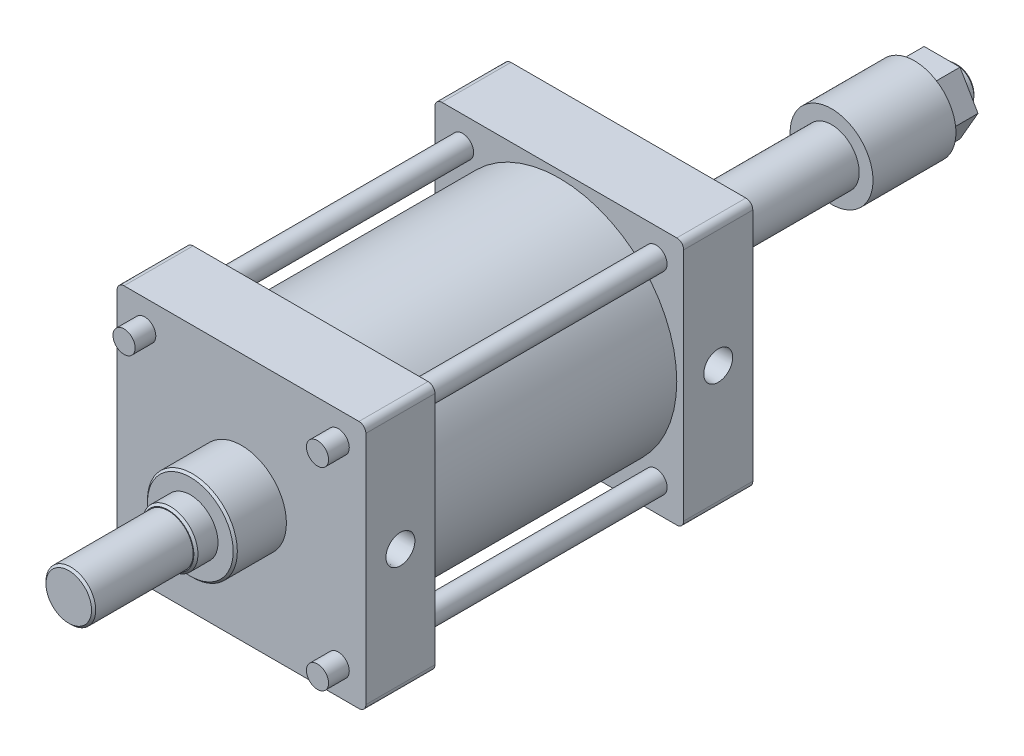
from build123d import *

# Parameters (mm, degrees)
SKETCH_1_R              = 8
EXTRUDE_1_DEPTH         = 50
SKETCH_2_R              = 85
EXTRUDE_2_DEPTH         = 180
EXTRUDE_START           = 50
SKETCH_3_R              = 8
EXTRUDE_3_DEPTH         = 50
SKETCH_4_R              = 32.5
EXTRUDE_4_DEPTH         = 37
EXTRUDE_START_2         = 37
SKETCH_5_R              = 32.5
EXTRUDE_5_DEPTH         = 37
SKETCH_6_R              = 20
EXTRUDE_7_DEPTH         = 16
SKETCH_7_R              = 18
EXTRUDE_8_DEPTH         = 72
CHAMFER_1_SIZE          = 1.5
SKETCH_8_R              = 30
EXTRUDE_9_DEPTH         = 10
EXTRUDE_START_3         = 100
SKETCH_9_R              = 20
EXTRUDE_10_DEPTH        = 100
SKETCH_10_R             = 30
EXTRUDE_11_DEPTH        = 60
EXTRUDE_12_DEPTH        = 20
SKETCH_12_R             = 13.5
EXTRUDE_13_DEPTH        = 11
CHAMFER_2_SIZE          = 1.5
EXTRUDE_14_DEPTH        = 15
EXTRUDE_14_DEPTH_BACK   = 280
SKETCH_13_R             = 8
EXTRUDE_14_2_DEPTH      = 15
EXTRUDE_14_2_DEPTH_BACK = 280
EXTRUDE_14_3_DEPTH      = 15
EXTRUDE_14_3_DEPTH_BACK = 280
EXTRUDE_14_4_DEPTH      = 15
EXTRUDE_14_4_DEPTH_BACK = 280
F_1_2_RC_1_AT_2_COUNT   = 2
F_1_2_RC_1_AT_2_PITCH   = 230


with BuildPart() as part:
    # Sketch 1 → Extrude 1 (new body)
    with BuildSketch(Plane.XY):
        with BuildLine():
            Line((85, 90), (-85, 90))
            ThreePointArc((-85, 90), (-88.535533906, 88.535533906), (-90, 85))
            Line((-90, 85), (-90, -85))
            ThreePointArc((-90, -85), (-88.535533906, -88.535533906), (-85, -90))
            Line((-85, -90), (85, -90))
            ThreePointArc((85, -90), (88.535533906, -88.535533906), (90, -85))
            Line((90, -85), (90, 85))
            ThreePointArc((90, 85), (88.535533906, 88.535533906), (85, 90))
        make_face()
        with Locations((70, -70)):
            Circle(SKETCH_1_R, mode=Mode.SUBTRACT)
        with Locations((-70, -70)):
            Circle(SKETCH_1_R, mode=Mode.SUBTRACT)
        with Locations((-70, 70)):
            Circle(SKETCH_1_R, mode=Mode.SUBTRACT)
        with Locations((70, 70)):
            Circle(SKETCH_1_R, mode=Mode.SUBTRACT)
    extrude(amount=EXTRUDE_1_DEPTH)

    # Sketch 2 → Extrude 2 (add)
    with BuildSketch(Plane(origin=(0, 0, 0), x_dir=(-1, 0, 0), z_dir=(0, 0, -1))):
        with Locations(Location((0, 0, 0), (0, 0, 180))):
            Circle(SKETCH_2_R)
    extrude(amount=EXTRUDE_2_DEPTH)

    # Sketch 3 → Extrude 3 (add)
    with BuildSketch(Plane(origin=(0, 0, -180), x_dir=(-1, 0, 0), z_dir=(0, 0, -1)).offset(EXTRUDE_START)):
        with BuildLine():
            Line((90, -85), (90, 85))
            ThreePointArc((90, 85), (88.535533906, 88.535533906), (85, 90))
            Line((85, 90), (-85, 90))
            ThreePointArc((-85, 90), (-88.535533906, 88.535533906), (-90, 85))
            Line((-90, 85), (-90, -85))
            ThreePointArc((-90, -85), (-88.535533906, -88.535533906), (-85, -90))
            Line((-85, -90), (85, -90))
            ThreePointArc((85, -90), (88.535533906, -88.535533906), (90, -85))
        make_face()
        with Locations(Location((70, -70, 0), (0, 0, 180))):
            Circle(SKETCH_3_R, mode=Mode.SUBTRACT)
        with Locations(Location((-70, -70, 0), (0, 0, 180))):
            Circle(SKETCH_3_R, mode=Mode.SUBTRACT)
        with Locations(Location((70, 70, 0), (0, 0, 180))):
            Circle(SKETCH_3_R, mode=Mode.SUBTRACT)
        with Locations(Location((-70, 70, 0), (0, 0, 180))):
            Circle(SKETCH_3_R, mode=Mode.SUBTRACT)
    extrude(amount=-EXTRUDE_3_DEPTH)

    # Sketch 4 → Extrude 4 (add)
    with BuildSketch(Plane.XY.offset(50)):
        Circle(SKETCH_4_R)
    extrude(amount=EXTRUDE_4_DEPTH)

    # Sketch 5 → Extrude 5 (add)
    with BuildSketch(Plane(origin=(0, 0, -230), x_dir=(-1, 0, 0), z_dir=(0, 0, -1)).offset(EXTRUDE_START_2)):
        with Locations(Location((0, 0, 0), (0, 0, 180))):
            Circle(SKETCH_5_R)
    extrude(amount=-EXTRUDE_5_DEPTH)

    # Sketch 6 → Extrude 7 (add)
    with BuildSketch(Plane.XY.offset(87)):
        Circle(SKETCH_6_R)
    extrude(amount=EXTRUDE_7_DEPTH)

    # Sketch 7 → Extrude 8 (add)
    with BuildSketch(Plane.XY.offset(103)):
        Circle(SKETCH_7_R)
    extrude(amount=EXTRUDE_8_DEPTH)

    # Chamfer 1
    chamfer_1_edges = [part.edges().sort_by_distance(p)[0] for p in [
        (-32.5, 0, 87),
        (-20, 0, 103),
        (-18, 0, 175),
    ]]
    chamfer(chamfer_1_edges, length=CHAMFER_1_SIZE)

    # Sketch 8 → Extrude 9 (add)
    with BuildSketch(Plane(origin=(0, 0, -267), x_dir=(-1, 0, 0), z_dir=(0, 0, -1))):
        Circle(SKETCH_8_R)
    extrude(amount=EXTRUDE_9_DEPTH)

    # Sketch 9 → Extrude 10 (add)
    with BuildSketch(Plane(origin=(0, 0, -277), x_dir=(-1, 0, 0), z_dir=(0, 0, -1)).offset(EXTRUDE_START_3)):
        Circle(SKETCH_9_R)
    extrude(amount=-EXTRUDE_10_DEPTH)

    # Sketch 10 → Extrude 11 (add)
    with BuildSketch(Plane(origin=(0, 0, -377), x_dir=(-1, 0, 0), z_dir=(0, 0, -1))):
        Circle(SKETCH_10_R)
    extrude(amount=EXTRUDE_11_DEPTH)

    # Sketch 11 → Extrude 12 (add)
    with BuildSketch(Plane(origin=(0, 0, -437), x_dir=(-1, 0, 0), z_dir=(0, 0, -1))):
        Polygon((-25.980762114, 0), (-12.990381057, -22.5), (12.990381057, -22.5), (25.980762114, 0), (12.990381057, 22.5), (-12.990381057, 22.5), align=None)
    extrude(amount=EXTRUDE_12_DEPTH)

    # Sketch 12 → Extrude 13 (add)
    with BuildSketch(Plane(origin=(0, 0, -457), x_dir=(-1, 0, 0), z_dir=(0, 0, -1))):
        Circle(SKETCH_12_R)
    extrude(amount=EXTRUDE_13_DEPTH)

    # Chamfer 2
    chamfer_2_edges = [part.edges().sort_by_distance(p)[0] for p in [
        (13.5, 0, -468),
    ]]
    chamfer(chamfer_2_edges, length=CHAMFER_2_SIZE)

    # Sketch 15 → 1_2 Rc _1 (revolve, cut)
    with BuildSketch(Plane(origin=(90, 0, 25), x_dir=(0, 0, -1), z_dir=(0, 1, 0))):
        Polygon((0, 0), (0, 29.327530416), (8.75, 24.07), (8.75, 15), (10.009250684, 15), (10.4775, 0), align=None)
    f_1_2_rc_1 = revolve(axis=Axis((96.35, 0, 25), (-1, 0, 0)), mode=Mode.SUBTRACT)

    # 1_2 Rc _1 at 2: 1_2 Rc _1 ×2
    with Locations(*[(0, 0, -i * F_1_2_RC_1_AT_2_PITCH) for i in range(1, F_1_2_RC_1_AT_2_COUNT)]):
        add(f_1_2_rc_1, mode=Mode.SUBTRACT)


with BuildPart() as body_2:
    # Sketch 13 → Extrude 14 (new, two sides: drawn at the far end of the back side and taken through both)
    with BuildSketch(Plane.XY.offset(50).offset(-EXTRUDE_14_DEPTH_BACK)):
        with Locations((70, -70)):
            Circle(SKETCH_13_R)
    extrude(amount=EXTRUDE_14_DEPTH + EXTRUDE_14_DEPTH_BACK)


with BuildPart() as body_3:
    # Sketch 13 → Extrude 14 2 (new, two sides: drawn at the far end of the back side and taken through both)
    with BuildSketch(Plane.XY.offset(50).offset(-EXTRUDE_14_2_DEPTH_BACK)):
        with Locations((-70, -70)):
            Circle(SKETCH_13_R)
    extrude(amount=EXTRUDE_14_2_DEPTH + EXTRUDE_14_2_DEPTH_BACK)


with BuildPart() as body_4:
    # Sketch 13 → Extrude 14 3 (new, two sides: drawn at the far end of the back side and taken through both)
    with BuildSketch(Plane.XY.offset(50).offset(-EXTRUDE_14_3_DEPTH_BACK)):
        with Locations((-70, 70)):
            Circle(SKETCH_13_R)
    extrude(amount=EXTRUDE_14_3_DEPTH + EXTRUDE_14_3_DEPTH_BACK)


with BuildPart() as body_5:
    # Sketch 13 → Extrude 14 4 (new, two sides: drawn at the far end of the back side and taken through both)
    with BuildSketch(Plane.XY.offset(50).offset(-EXTRUDE_14_4_DEPTH_BACK)):
        with Locations((70, 70)):
            Circle(SKETCH_13_R)
    extrude(amount=EXTRUDE_14_4_DEPTH + EXTRUDE_14_4_DEPTH_BACK)


solid = Compound([part.part, body_2.part, body_3.part, body_4.part, body_5.part])
